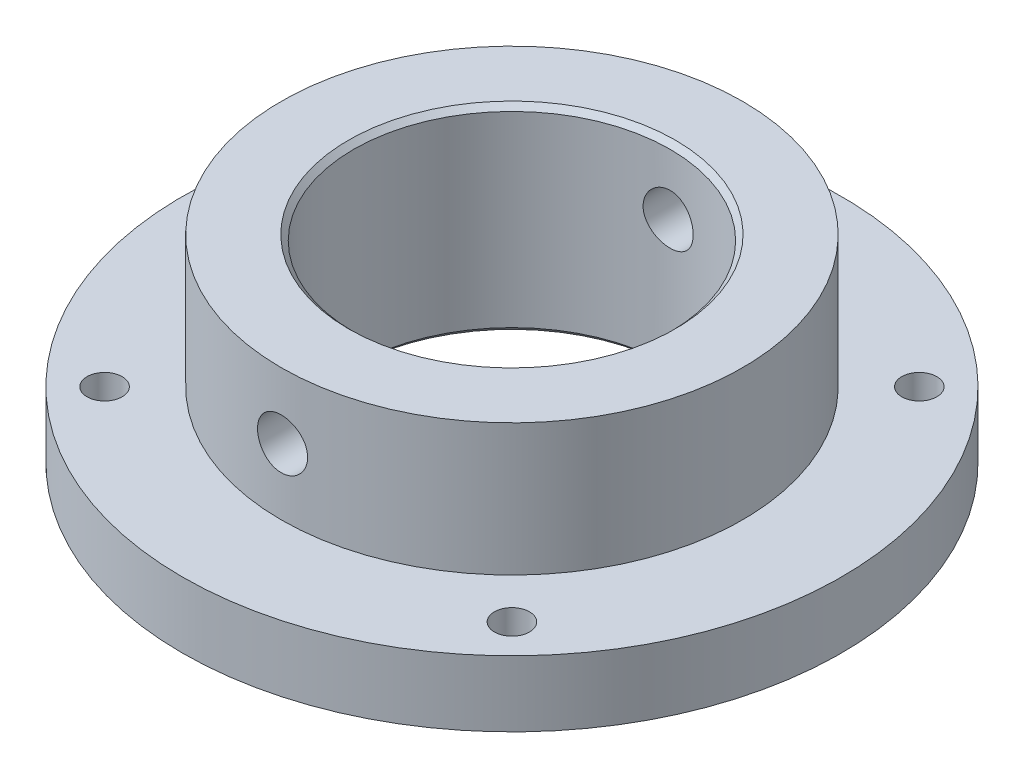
from build123d import *

# Parameters (mm, degrees)
CHAMFER1_SIZE      = 1.016
SKETCH2_R          = 4.826
CUT_EXTRUDE1_DEPTH = 48.26
SKETCH3_R          = 3.3782
CUT_EXTRUDE2_DEPTH = 98.550550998
CIRPATTERN1_COUNT  = 4


with BuildPart() as part:
    # Sketch1 → Revolve1 (revolve)
    with BuildSketch(Plane.XY, mode=Mode.PRIVATE) as revolve1_sk:
        Polygon((30.48, 0), (44.45, 0), (44.45, -25.4), (63.5, -25.4), (63.5, -38.1), (30.48, -38.1), align=None)
    revolve(revolve1_sk.sketch.rotate(Axis((0, 0, 0), (0, -1, 0)), 90), axis=Axis((0, 0, 0), (0, -1, 0)))

    # Chamfer1
    chamfer1_edges = [part.edges().sort_by_distance(p)[0] for p in [
        (0, -38.1, -30.48),
        (0, 0, -30.48),
    ]]
    chamfer(chamfer1_edges, length=CHAMFER1_SIZE)

    # Sketch2 → Cut-Extrude1 (cut, symmetric)
    with BuildSketch(Plane.XY):
        with Locations((0, -12.7)):
            Circle(SKETCH2_R)
    extrude(amount=CUT_EXTRUDE1_DEPTH, both=True, mode=Mode.SUBTRACT)

    # Sketch3 → Cut-Extrude2 (cut, through all)
    with BuildSketch(Plane(origin=(0, 0, 0), x_dir=(1, 0, 0), z_dir=(0, 1, 0))):
        with Locations(Location((-39.243719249, 39.243719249, 0), (0, 0, 270))):
            Circle(SKETCH3_R)
    cut_extrude2 = extrude(amount=-CUT_EXTRUDE2_DEPTH, mode=Mode.SUBTRACT)

    # CirPattern1: Cut-Extrude2 ×4 about axis
    cirpattern1_axis = Axis((0, 0, 0), (0, 1, 0))
    for i in range(1, CIRPATTERN1_COUNT):
        add(cut_extrude2.rotate(cirpattern1_axis, i * 360 / CIRPATTERN1_COUNT), mode=Mode.SUBTRACT)


solid = part.part
